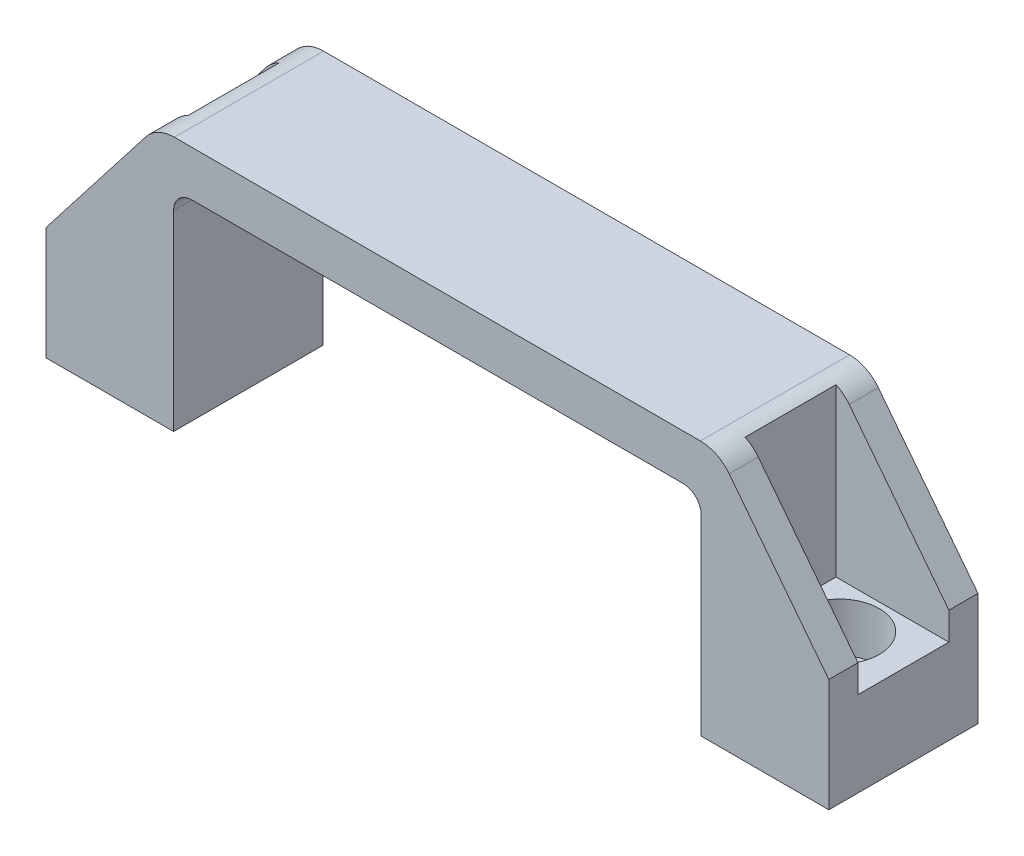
ISO-10303-21;
HEADER;
FILE_DESCRIPTION(('STEP AP214'),'2;1');
FILE_NAME('part.step','',(''),(''),'','','');
FILE_SCHEMA(('AUTOMOTIVE_DESIGN { 1 0 10303 214 1 1 1 1 }'));
ENDSEC;
DATA;
#1=APPLICATION_CONTEXT('core data for automotive mechanical design processes');
#2=APPLICATION_PROTOCOL_DEFINITION('international standard','automotive_design',2000,#1);
#3=PRODUCT_CONTEXT('',#1,'mechanical');
#4=PRODUCT('Part','Part','',(#3));
#5=PRODUCT_RELATED_PRODUCT_CATEGORY('part','',(#4));
#6=PRODUCT_DEFINITION_FORMATION('','',#4);
#7=PRODUCT_DEFINITION_CONTEXT('part definition',#1,'design');
#8=PRODUCT_DEFINITION('design','',#6,#7);
#9=PRODUCT_DEFINITION_SHAPE('','',#8);
#10=(LENGTH_UNIT() NAMED_UNIT(*) SI_UNIT(.MILLI.,.METRE.));
#11=(NAMED_UNIT(*) PLANE_ANGLE_UNIT() SI_UNIT($,.RADIAN.));
#12=(NAMED_UNIT(*) SI_UNIT($,.STERADIAN.) SOLID_ANGLE_UNIT());
#13=UNCERTAINTY_MEASURE_WITH_UNIT(LENGTH_MEASURE(1.E-05),#10,'distance_accuracy_value','');
#14=(GEOMETRIC_REPRESENTATION_CONTEXT(3) GLOBAL_UNCERTAINTY_ASSIGNED_CONTEXT((#13)) GLOBAL_UNIT_ASSIGNED_CONTEXT((#10,
#11,#12)) REPRESENTATION_CONTEXT('',''));
#15=CARTESIAN_POINT('',(0.,0.,0.));
#16=DIRECTION('',(0.,0.,1.));
#17=DIRECTION('',(1.,0.,0.));
#18=AXIS2_PLACEMENT_3D('',#15,#16,#17);
#19=CARTESIAN_POINT('',(0.,15.75435,10.414));
#20=DIRECTION('',(0.78974592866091,-0.613434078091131,0.));
#21=DIRECTION('',(0.613434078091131,0.78974592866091,0.));
#22=AXIS2_PLACEMENT_3D('',#19,#20,#21);
#23=PLANE('',#22);
#24=DIRECTION('',(0.,0.,-1.));
#25=VECTOR('',#24,1.);
#26=CARTESIAN_POINT('',(0.,15.75435,10.414));
#27=LINE('',#26,#25);
#28=CARTESIAN_POINT('',(0.,15.75435,-6.35));
#29=VERTEX_POINT('',#28);
#30=CARTESIAN_POINT('',(0.,15.75435,-10.414));
#31=VERTEX_POINT('',#30);
#32=EDGE_CURVE('E172',#29,#31,#27,.T.);
#33=ORIENTED_EDGE('',*,*,#32,.F.);
#34=DIRECTION('',(0.613434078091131,0.78974592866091,0.));
#35=VECTOR('',#34,1.);
#36=CARTESIAN_POINT('',(0.,15.75435,-6.35));
#37=LINE('',#36,#35);
#38=CARTESIAN_POINT('',(13.9178560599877,33.6724451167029,-6.35));
#39=VERTEX_POINT('',#38);
#40=EDGE_CURVE('E221',#29,#39,#37,.T.);
#41=ORIENTED_EDGE('',*,*,#40,.T.);
#42=DIRECTION('',(0.,0.,-1.));
#43=VECTOR('',#42,1.);
#44=CARTESIAN_POINT('',(13.9178560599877,33.6724451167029,10.414));
#45=LINE('',#44,#43);
#46=CARTESIAN_POINT('',(13.9178560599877,33.6724451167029,-10.414));
#47=VERTEX_POINT('',#46);
#48=EDGE_CURVE('E140',#39,#47,#45,.T.);
#49=ORIENTED_EDGE('',*,*,#48,.T.);
#50=DIRECTION('',(-0.613434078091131,-0.78974592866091,0.));
#51=VECTOR('',#50,1.);
#52=CARTESIAN_POINT('',(0.,15.75435,-10.414));
#53=LINE('',#52,#51);
#54=EDGE_CURVE('E166',#47,#31,#53,.T.);
#55=ORIENTED_EDGE('',*,*,#54,.T.);
#56=EDGE_LOOP('',(#33,#41,#49,#55));
#57=FACE_BOUND('',#56,.T.);
#58=ADVANCED_FACE('F39',(#57),#23,.F.);
#59=CARTESIAN_POINT('',(17.8181,0.,10.414));
#60=DIRECTION('',(0.,1.,0.));
#61=DIRECTION('',(-1.,0.,0.));
#62=AXIS2_PLACEMENT_3D('',#59,#60,#61);
#63=PLANE('',#62);
#64=CARTESIAN_POINT('',(8.9281,0.,0.));
#65=DIRECTION('',(0.,1.,0.));
#66=DIRECTION('',(0.,0.,1.));
#67=AXIS2_PLACEMENT_3D('',#64,#65,#66);
#68=CIRCLE('',#67,3.3782);
#69=CARTESIAN_POINT('',(8.9281,0.,3.3782));
#70=VERTEX_POINT('',#69);
#71=EDGE_CURVE('E256',#70,#70,#68,.T.);
#72=ORIENTED_EDGE('',*,*,#71,.T.);
#73=EDGE_LOOP('',(#72));
#74=FACE_BOUND('',#73,.T.);
#75=DIRECTION('',(1.,0.,0.));
#76=VECTOR('',#75,1.);
#77=CARTESIAN_POINT('',(17.8181,0.,-10.414));
#78=LINE('',#77,#76);
#79=CARTESIAN_POINT('',(0.,0.,-10.414));
#80=VERTEX_POINT('',#79);
#81=CARTESIAN_POINT('',(17.8181,0.,-10.414));
#82=VERTEX_POINT('',#81);
#83=EDGE_CURVE('E150',#80,#82,#78,.T.);
#84=ORIENTED_EDGE('',*,*,#83,.T.);
#85=DIRECTION('',(0.,0.,-1.));
#86=VECTOR('',#85,1.);
#87=CARTESIAN_POINT('',(17.8181,0.,10.414));
#88=LINE('',#87,#86);
#89=CARTESIAN_POINT('',(17.8181,0.,10.414));
#90=VERTEX_POINT('',#89);
#91=EDGE_CURVE('E47',#90,#82,#88,.T.);
#92=ORIENTED_EDGE('',*,*,#91,.F.);
#93=DIRECTION('',(1.,0.,0.));
#94=VECTOR('',#93,1.);
#95=CARTESIAN_POINT('',(17.8181,0.,10.414));
#96=LINE('',#95,#94);
#97=CARTESIAN_POINT('',(0.,0.,10.414));
#98=VERTEX_POINT('',#97);
#99=EDGE_CURVE('E170',#98,#90,#96,.T.);
#100=ORIENTED_EDGE('',*,*,#99,.F.);
#101=DIRECTION('',(0.,0.,-1.));
#102=VECTOR('',#101,1.);
#103=CARTESIAN_POINT('',(0.,0.,10.414));
#104=LINE('',#103,#102);
#105=EDGE_CURVE('E146',#98,#80,#104,.T.);
#106=ORIENTED_EDGE('',*,*,#105,.T.);
#107=EDGE_LOOP('',(#84,#92,#100,#106));
#108=FACE_BOUND('',#107,.T.);
#109=ADVANCED_FACE('F41',(#74,#108),#63,.F.);
#110=CARTESIAN_POINT('',(17.8181,26.7462,10.414));
#111=DIRECTION('',(-1.,0.,0.));
#112=DIRECTION('',(0.,-1.,0.));
#113=AXIS2_PLACEMENT_3D('',#110,#111,#112);
#114=PLANE('',#113);
#115=DIRECTION('',(0.,1.,0.));
#116=VECTOR('',#115,1.);
#117=CARTESIAN_POINT('',(17.8181,26.7462,-10.414));
#118=LINE('',#117,#116);
#119=CARTESIAN_POINT('',(17.8181,26.7462,-10.414));
#120=VERTEX_POINT('',#119);
#121=EDGE_CURVE('E153',#82,#120,#118,.T.);
#122=ORIENTED_EDGE('',*,*,#121,.T.);
#123=DIRECTION('',(0.,0.,-1.));
#124=VECTOR('',#123,1.);
#125=CARTESIAN_POINT('',(17.8181,26.7462,10.414));
#126=LINE('',#125,#124);
#127=CARTESIAN_POINT('',(17.8181,26.7462,10.414));
#128=VERTEX_POINT('',#127);
#129=EDGE_CURVE('E180',#128,#120,#126,.T.);
#130=ORIENTED_EDGE('',*,*,#129,.F.);
#131=DIRECTION('',(0.,1.,0.));
#132=VECTOR('',#131,1.);
#133=CARTESIAN_POINT('',(17.8181,26.7462,10.414));
#134=LINE('',#133,#132);
#135=EDGE_CURVE('E101',#90,#128,#134,.T.);
#136=ORIENTED_EDGE('',*,*,#135,.F.);
#137=ORIENTED_EDGE('',*,*,#91,.T.);
#138=EDGE_LOOP('',(#122,#130,#136,#137));
#139=FACE_BOUND('',#138,.T.);
#140=ADVANCED_FACE('F183',(#139),#114,.F.);
#141=CARTESIAN_POINT('',(20.3581,26.7462,10.414));
#142=DIRECTION('',(0.,0.,-1.));
#143=DIRECTION('',(-1.,0.,0.));
#144=AXIS2_PLACEMENT_3D('',#141,#142,#143);
#145=CYLINDRICAL_SURFACE('',#144,2.54);
#146=CARTESIAN_POINT('',(20.3581,26.7462,-10.414));
#147=DIRECTION('',(0.,0.,-1.));
#148=DIRECTION('',(1.,0.,0.));
#149=AXIS2_PLACEMENT_3D('',#146,#147,#148);
#150=CIRCLE('',#149,2.54);
#151=CARTESIAN_POINT('',(20.3581,29.2862,-10.414));
#152=VERTEX_POINT('',#151);
#153=EDGE_CURVE('E156',#120,#152,#150,.T.);
#154=ORIENTED_EDGE('',*,*,#153,.T.);
#155=DIRECTION('',(0.,0.,-1.));
#156=VECTOR('',#155,1.);
#157=CARTESIAN_POINT('',(20.3581,29.2862,10.414));
#158=LINE('',#157,#156);
#159=CARTESIAN_POINT('',(20.3581,29.2862,10.414));
#160=VERTEX_POINT('',#159);
#161=EDGE_CURVE('E176',#160,#152,#158,.T.);
#162=ORIENTED_EDGE('',*,*,#161,.F.);
#163=CARTESIAN_POINT('',(20.3581,26.7462,10.414));
#164=DIRECTION('',(0.,0.,-1.));
#165=DIRECTION('',(1.,0.,0.));
#166=AXIS2_PLACEMENT_3D('',#163,#164,#165);
#167=CIRCLE('',#166,2.54);
#168=EDGE_CURVE('E210',#128,#160,#167,.T.);
#169=ORIENTED_EDGE('',*,*,#168,.F.);
#170=ORIENTED_EDGE('',*,*,#129,.T.);
#171=EDGE_LOOP('',(#154,#162,#169,#170));
#172=FACE_BOUND('',#171,.T.);
#173=ADVANCED_FACE('F195',(#172),#145,.F.);
#174=CARTESIAN_POINT('',(54.6481,29.2862,10.414));
#175=DIRECTION('',(0.,1.,0.));
#176=DIRECTION('',(0.,0.,1.));
#177=AXIS2_PLACEMENT_3D('',#174,#175,#176);
#178=PLANE('',#177);
#179=DIRECTION('',(1.,0.,0.));
#180=VECTOR('',#179,1.);
#181=CARTESIAN_POINT('',(54.6481,29.2862,-10.414));
#182=LINE('',#181,#180);
#183=CARTESIAN_POINT('',(88.9381,29.2862,-10.414));
#184=VERTEX_POINT('',#183);
#185=EDGE_CURVE('E158',#152,#184,#182,.T.);
#186=ORIENTED_EDGE('',*,*,#185,.T.);
#187=DIRECTION('',(0.,0.,-1.));
#188=VECTOR('',#187,1.);
#189=CARTESIAN_POINT('',(88.9381,29.2862,10.414));
#190=LINE('',#189,#188);
#191=CARTESIAN_POINT('',(88.9381,29.2862,10.414));
#192=VERTEX_POINT('',#191);
#193=EDGE_CURVE('E206',#192,#184,#190,.T.);
#194=ORIENTED_EDGE('',*,*,#193,.F.);
#195=DIRECTION('',(1.,0.,0.));
#196=VECTOR('',#195,1.);
#197=CARTESIAN_POINT('',(54.6481,29.2862,10.414));
#198=LINE('',#197,#196);
#199=EDGE_CURVE('E204',#160,#192,#198,.T.);
#200=ORIENTED_EDGE('',*,*,#199,.F.);
#201=ORIENTED_EDGE('',*,*,#161,.T.);
#202=EDGE_LOOP('',(#186,#194,#200,#201));
#203=FACE_BOUND('',#202,.T.);
#204=ADVANCED_FACE('F199',(#203),#178,.F.);
#205=CARTESIAN_POINT('',(17.9297653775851,35.6362,10.414));
#206=DIRECTION('',(0.,-1.,0.));
#207=DIRECTION('',(0.,0.,-1.));
#208=AXIS2_PLACEMENT_3D('',#205,#206,#207);
#209=PLANE('',#208);
#210=DIRECTION('',(-1.,0.,0.));
#211=VECTOR('',#210,1.);
#212=CARTESIAN_POINT('',(17.9297653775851,35.6362,-10.414));
#213=LINE('',#212,#211);
#214=CARTESIAN_POINT('',(91.3664346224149,35.6362,-10.414));
#215=VERTEX_POINT('',#214);
#216=CARTESIAN_POINT('',(17.9297653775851,35.6362,-10.414));
#217=VERTEX_POINT('',#216);
#218=EDGE_CURVE('E161',#215,#217,#213,.T.);
#219=ORIENTED_EDGE('',*,*,#218,.T.);
#220=DIRECTION('',(0.,0.,-1.));
#221=VECTOR('',#220,1.);
#222=CARTESIAN_POINT('',(17.9297653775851,35.6362,10.414));
#223=LINE('',#222,#221);
#224=CARTESIAN_POINT('',(17.9297653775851,35.6362,10.414));
#225=VERTEX_POINT('',#224);
#226=EDGE_CURVE('E139',#225,#217,#223,.T.);
#227=ORIENTED_EDGE('',*,*,#226,.F.);
#228=DIRECTION('',(-1.,0.,0.));
#229=VECTOR('',#228,1.);
#230=CARTESIAN_POINT('',(17.9297653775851,35.6362,10.414));
#231=LINE('',#230,#229);
#232=CARTESIAN_POINT('',(91.3664346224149,35.6362,10.414));
#233=VERTEX_POINT('',#232);
#234=EDGE_CURVE('E123',#233,#225,#231,.T.);
#235=ORIENTED_EDGE('',*,*,#234,.F.);
#236=DIRECTION('',(0.,0.,-1.));
#237=VECTOR('',#236,1.);
#238=CARTESIAN_POINT('',(91.3664346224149,35.6362,10.414));
#239=LINE('',#238,#237);
#240=EDGE_CURVE('E269',#233,#215,#239,.T.);
#241=ORIENTED_EDGE('',*,*,#240,.T.);
#242=EDGE_LOOP('',(#219,#227,#235,#241));
#243=FACE_BOUND('',#242,.T.);
#244=ADVANCED_FACE('F441',(#243),#209,.F.);
#245=CARTESIAN_POINT('',(17.9297653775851,30.5562,10.414));
#246=DIRECTION('',(0.,0.,-1.));
#247=DIRECTION('',(-1.,0.,0.));
#248=AXIS2_PLACEMENT_3D('',#245,#246,#247);
#249=CYLINDRICAL_SURFACE('',#248,5.08);
#250=ORIENTED_EDGE('',*,*,#48,.F.);
#251=CARTESIAN_POINT('',(17.9297653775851,30.5562,-6.35));
#252=DIRECTION('',(0.,0.,-1.));
#253=DIRECTION('',(-1.,0.,0.));
#254=AXIS2_PLACEMENT_3D('',#251,#252,#253);
#255=CIRCLE('',#254,5.08);
#256=CARTESIAN_POINT('',(15.75435,35.1468391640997,-6.35));
#257=VERTEX_POINT('',#256);
#258=EDGE_CURVE('E154',#39,#257,#255,.T.);
#259=ORIENTED_EDGE('',*,*,#258,.T.);
#260=DIRECTION('',(0.,0.,-1.));
#261=VECTOR('',#260,1.);
#262=CARTESIAN_POINT('',(15.75435,35.1468391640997,10.414));
#263=LINE('',#262,#261);
#264=CARTESIAN_POINT('',(15.75435,35.1468391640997,6.34999999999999));
#265=VERTEX_POINT('',#264);
#266=EDGE_CURVE('E11',#257,#265,#263,.F.);
#267=ORIENTED_EDGE('',*,*,#266,.T.);
#268=CARTESIAN_POINT('',(17.9297653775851,30.5562,6.34999999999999));
#269=DIRECTION('',(0.,0.,1.));
#270=DIRECTION('',(1.,0.,0.));
#271=AXIS2_PLACEMENT_3D('',#268,#269,#270);
#272=CIRCLE('',#271,5.08);
#273=CARTESIAN_POINT('',(13.9178560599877,33.6724451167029,6.35));
#274=VERTEX_POINT('',#273);
#275=EDGE_CURVE('E136',#265,#274,#272,.T.);
#276=ORIENTED_EDGE('',*,*,#275,.T.);
#277=CARTESIAN_POINT('',(13.9178560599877,33.6724451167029,10.414));
#278=VERTEX_POINT('',#277);
#279=EDGE_CURVE('E131',#278,#274,#45,.T.);
#280=ORIENTED_EDGE('',*,*,#279,.F.);
#281=CARTESIAN_POINT('',(17.9297653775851,30.5562,10.414));
#282=DIRECTION('',(0.,0.,1.));
#283=DIRECTION('',(-1.,0.,0.));
#284=AXIS2_PLACEMENT_3D('',#281,#282,#283);
#285=CIRCLE('',#284,5.08);
#286=EDGE_CURVE('E115',#225,#278,#285,.T.);
#287=ORIENTED_EDGE('',*,*,#286,.F.);
#288=ORIENTED_EDGE('',*,*,#226,.T.);
#289=CARTESIAN_POINT('',(17.9297653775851,30.5562,-10.414));
#290=DIRECTION('',(0.,0.,1.));
#291=DIRECTION('',(-1.,0.,0.));
#292=AXIS2_PLACEMENT_3D('',#289,#290,#291);
#293=CIRCLE('',#292,5.08);
#294=EDGE_CURVE('E163',#217,#47,#293,.T.);
#295=ORIENTED_EDGE('',*,*,#294,.T.);
#296=EDGE_LOOP('',(#250,#259,#267,#276,#280,#287,#288,#295));
#297=FACE_BOUND('',#296,.T.);
#298=ADVANCED_FACE('F133',(#297),#249,.T.);
#299=ORIENTED_EDGE('',*,*,#279,.T.);
#300=DIRECTION('',(-0.613434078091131,-0.78974592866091,0.));
#301=VECTOR('',#300,1.);
#302=CARTESIAN_POINT('',(0.,15.75435,6.35));
#303=LINE('',#302,#301);
#304=CARTESIAN_POINT('',(0.,15.75435,6.35));
#305=VERTEX_POINT('',#304);
#306=EDGE_CURVE('E225',#274,#305,#303,.T.);
#307=ORIENTED_EDGE('',*,*,#306,.T.);
#308=CARTESIAN_POINT('',(0.,15.75435,10.414));
#309=VERTEX_POINT('',#308);
#310=EDGE_CURVE('E144',#309,#305,#27,.T.);
#311=ORIENTED_EDGE('',*,*,#310,.F.);
#312=DIRECTION('',(-0.613434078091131,-0.78974592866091,0.));
#313=VECTOR('',#312,1.);
#314=CARTESIAN_POINT('',(0.,15.75435,10.414));
#315=LINE('',#314,#313);
#316=EDGE_CURVE('E119',#278,#309,#315,.T.);
#317=ORIENTED_EDGE('',*,*,#316,.F.);
#318=EDGE_LOOP('',(#299,#307,#311,#317));
#319=FACE_BOUND('',#318,.T.);
#320=ADVANCED_FACE('F142',(#319),#23,.F.);
#321=CARTESIAN_POINT('',(0.,0.,10.414));
#322=DIRECTION('',(1.,0.,0.));
#323=DIRECTION('',(0.,0.,-1.));
#324=AXIS2_PLACEMENT_3D('',#321,#322,#323);
#325=PLANE('',#324);
#326=DIRECTION('',(0.,0.,1.));
#327=VECTOR('',#326,1.);
#328=CARTESIAN_POINT('',(0.,11.8872,6.35));
#329=LINE('',#328,#327);
#330=CARTESIAN_POINT('',(0.,11.8872,-6.35));
#331=VERTEX_POINT('',#330);
#332=CARTESIAN_POINT('',(0.,11.8872,6.35));
#333=VERTEX_POINT('',#332);
#334=EDGE_CURVE('E244',#331,#333,#329,.T.);
#335=ORIENTED_EDGE('',*,*,#334,.F.);
#336=DIRECTION('',(0.,1.,0.));
#337=VECTOR('',#336,1.);
#338=CARTESIAN_POINT('',(0.,11.8872,-6.35));
#339=LINE('',#338,#337);
#340=EDGE_CURVE('E228',#331,#29,#339,.T.);
#341=ORIENTED_EDGE('',*,*,#340,.T.);
#342=ORIENTED_EDGE('',*,*,#32,.T.);
#343=DIRECTION('',(0.,-1.,0.));
#344=VECTOR('',#343,1.);
#345=CARTESIAN_POINT('',(0.,0.,-10.414));
#346=LINE('',#345,#344);
#347=EDGE_CURVE('E92',#31,#80,#346,.T.);
#348=ORIENTED_EDGE('',*,*,#347,.T.);
#349=ORIENTED_EDGE('',*,*,#105,.F.);
#350=DIRECTION('',(0.,-1.,0.));
#351=VECTOR('',#350,1.);
#352=CARTESIAN_POINT('',(0.,0.,10.414));
#353=LINE('',#352,#351);
#354=EDGE_CURVE('E63',#309,#98,#353,.T.);
#355=ORIENTED_EDGE('',*,*,#354,.F.);
#356=ORIENTED_EDGE('',*,*,#310,.T.);
#357=DIRECTION('',(0.,1.,0.));
#358=VECTOR('',#357,1.);
#359=CARTESIAN_POINT('',(0.,11.8872,6.35));
#360=LINE('',#359,#358);
#361=EDGE_CURVE('E231',#333,#305,#360,.T.);
#362=ORIENTED_EDGE('',*,*,#361,.F.);
#363=EDGE_LOOP('',(#335,#341,#342,#348,#349,#355,#356,#362));
#364=FACE_BOUND('',#363,.T.);
#365=ADVANCED_FACE('F515',(#364),#325,.F.);
#366=CARTESIAN_POINT('',(17.9297653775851,30.5562,10.414));
#367=DIRECTION('',(0.,0.,-1.));
#368=DIRECTION('',(-1.,0.,0.));
#369=AXIS2_PLACEMENT_3D('',#366,#367,#368);
#370=PLANE('',#369);
#371=ORIENTED_EDGE('',*,*,#99,.T.);
#372=ORIENTED_EDGE('',*,*,#135,.T.);
#373=ORIENTED_EDGE('',*,*,#168,.T.);
#374=ORIENTED_EDGE('',*,*,#199,.T.);
#375=CARTESIAN_POINT('',(88.9381,26.7462,10.414));
#376=DIRECTION('',(0.,0.,1.));
#377=DIRECTION('',(-1.,0.,0.));
#378=AXIS2_PLACEMENT_3D('',#375,#376,#377);
#379=CIRCLE('',#378,2.54);
#380=CARTESIAN_POINT('',(91.4781,26.7462,10.414));
#381=VERTEX_POINT('',#380);
#382=EDGE_CURVE('E311',#381,#192,#379,.T.);
#383=ORIENTED_EDGE('',*,*,#382,.F.);
#384=DIRECTION('',(0.,1.,0.));
#385=VECTOR('',#384,1.);
#386=CARTESIAN_POINT('',(91.4781,26.7462,10.414));
#387=LINE('',#386,#385);
#388=CARTESIAN_POINT('',(91.4781,0.,10.414));
#389=VERTEX_POINT('',#388);
#390=EDGE_CURVE('E313',#389,#381,#387,.T.);
#391=ORIENTED_EDGE('',*,*,#390,.F.);
#392=DIRECTION('',(-1.,0.,0.));
#393=VECTOR('',#392,1.);
#394=CARTESIAN_POINT('',(91.4781,0.,10.414));
#395=LINE('',#394,#393);
#396=CARTESIAN_POINT('',(109.2962,0.,10.414));
#397=VERTEX_POINT('',#396);
#398=EDGE_CURVE('E287',#397,#389,#395,.T.);
#399=ORIENTED_EDGE('',*,*,#398,.F.);
#400=DIRECTION('',(0.,-1.,0.));
#401=VECTOR('',#400,1.);
#402=CARTESIAN_POINT('',(109.2962,0.,10.414));
#403=LINE('',#402,#401);
#404=CARTESIAN_POINT('',(109.2962,15.75435,10.414));
#405=VERTEX_POINT('',#404);
#406=EDGE_CURVE('E283',#405,#397,#403,.T.);
#407=ORIENTED_EDGE('',*,*,#406,.F.);
#408=DIRECTION('',(0.613434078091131,-0.78974592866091,0.));
#409=VECTOR('',#408,1.);
#410=CARTESIAN_POINT('',(109.2962,15.75435,10.414));
#411=LINE('',#410,#409);
#412=CARTESIAN_POINT('',(95.3783439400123,33.6724451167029,10.414));
#413=VERTEX_POINT('',#412);
#414=EDGE_CURVE('E305',#413,#405,#411,.T.);
#415=ORIENTED_EDGE('',*,*,#414,.F.);
#416=CARTESIAN_POINT('',(91.3664346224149,30.5562,10.414));
#417=DIRECTION('',(0.,0.,-1.));
#418=DIRECTION('',(1.,0.,0.));
#419=AXIS2_PLACEMENT_3D('',#416,#417,#418);
#420=CIRCLE('',#419,5.08);
#421=EDGE_CURVE('E308',#233,#413,#420,.T.);
#422=ORIENTED_EDGE('',*,*,#421,.F.);
#423=ORIENTED_EDGE('',*,*,#234,.T.);
#424=ORIENTED_EDGE('',*,*,#286,.T.);
#425=ORIENTED_EDGE('',*,*,#316,.T.);
#426=ORIENTED_EDGE('',*,*,#354,.T.);
#427=EDGE_LOOP('',(#371,#372,#373,#374,#383,#391,#399,#407,#415,#422,#423,#424,#425,#426));
#428=FACE_BOUND('',#427,.T.);
#429=ADVANCED_FACE('F117',(#428),#370,.F.);
#430=CARTESIAN_POINT('',(17.9297653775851,30.5562,-10.414));
#431=DIRECTION('',(0.,0.,-1.));
#432=DIRECTION('',(-1.,0.,0.));
#433=AXIS2_PLACEMENT_3D('',#430,#431,#432);
#434=PLANE('',#433);
#435=ORIENTED_EDGE('',*,*,#83,.F.);
#436=ORIENTED_EDGE('',*,*,#347,.F.);
#437=ORIENTED_EDGE('',*,*,#54,.F.);
#438=ORIENTED_EDGE('',*,*,#294,.F.);
#439=ORIENTED_EDGE('',*,*,#218,.F.);
#440=CARTESIAN_POINT('',(91.3664346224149,30.5562,-10.414));
#441=DIRECTION('',(0.,0.,-1.));
#442=DIRECTION('',(1.,0.,0.));
#443=AXIS2_PLACEMENT_3D('',#440,#441,#442);
#444=CIRCLE('',#443,5.08);
#445=CARTESIAN_POINT('',(95.3783439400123,33.6724451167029,-10.414));
#446=VERTEX_POINT('',#445);
#447=EDGE_CURVE('E291',#215,#446,#444,.T.);
#448=ORIENTED_EDGE('',*,*,#447,.T.);
#449=DIRECTION('',(0.613434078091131,-0.78974592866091,0.));
#450=VECTOR('',#449,1.);
#451=CARTESIAN_POINT('',(109.2962,15.75435,-10.414));
#452=LINE('',#451,#450);
#453=CARTESIAN_POINT('',(109.2962,15.75435,-10.414));
#454=VERTEX_POINT('',#453);
#455=EDGE_CURVE('E288',#446,#454,#452,.T.);
#456=ORIENTED_EDGE('',*,*,#455,.T.);
#457=DIRECTION('',(0.,-1.,0.));
#458=VECTOR('',#457,1.);
#459=CARTESIAN_POINT('',(109.2962,0.,-10.414));
#460=LINE('',#459,#458);
#461=CARTESIAN_POINT('',(109.2962,0.,-10.414));
#462=VERTEX_POINT('',#461);
#463=EDGE_CURVE('E284',#454,#462,#460,.T.);
#464=ORIENTED_EDGE('',*,*,#463,.T.);
#465=DIRECTION('',(-1.,0.,0.));
#466=VECTOR('',#465,1.);
#467=CARTESIAN_POINT('',(91.4781,0.,-10.414));
#468=LINE('',#467,#466);
#469=CARTESIAN_POINT('',(91.4781,0.,-10.414));
#470=VERTEX_POINT('',#469);
#471=EDGE_CURVE('E299',#462,#470,#468,.T.);
#472=ORIENTED_EDGE('',*,*,#471,.T.);
#473=DIRECTION('',(0.,1.,0.));
#474=VECTOR('',#473,1.);
#475=CARTESIAN_POINT('',(91.4781,26.7462,-10.414));
#476=LINE('',#475,#474);
#477=CARTESIAN_POINT('',(91.4781,26.7462,-10.414));
#478=VERTEX_POINT('',#477);
#479=EDGE_CURVE('E296',#470,#478,#476,.T.);
#480=ORIENTED_EDGE('',*,*,#479,.T.);
#481=CARTESIAN_POINT('',(88.9381,26.7462,-10.414));
#482=DIRECTION('',(0.,0.,1.));
#483=DIRECTION('',(-1.,0.,0.));
#484=AXIS2_PLACEMENT_3D('',#481,#482,#483);
#485=CIRCLE('',#484,2.54);
#486=EDGE_CURVE('E294',#478,#184,#485,.T.);
#487=ORIENTED_EDGE('',*,*,#486,.T.);
#488=ORIENTED_EDGE('',*,*,#185,.F.);
#489=ORIENTED_EDGE('',*,*,#153,.F.);
#490=ORIENTED_EDGE('',*,*,#121,.F.);
#491=EDGE_LOOP('',(#435,#436,#437,#438,#439,#448,#456,#464,#472,#480,#487,#488,#489,#490));
#492=FACE_BOUND('',#491,.T.);
#493=ADVANCED_FACE('F188',(#492),#434,.T.);
#494=CARTESIAN_POINT('',(15.75435,11.8872,-6.35));
#495=DIRECTION('',(1.,0.,0.));
#496=DIRECTION('',(0.,0.,-1.));
#497=AXIS2_PLACEMENT_3D('',#494,#495,#496);
#498=PLANE('',#497);
#499=DIRECTION('',(0.,1.,0.));
#500=VECTOR('',#499,1.);
#501=CARTESIAN_POINT('',(15.75435,11.8872,-6.35));
#502=LINE('',#501,#500);
#503=CARTESIAN_POINT('',(15.75435,11.8872,-6.35));
#504=VERTEX_POINT('',#503);
#505=EDGE_CURVE('E227',#504,#257,#502,.T.);
#506=ORIENTED_EDGE('',*,*,#505,.F.);
#507=DIRECTION('',(0.,0.,-1.));
#508=VECTOR('',#507,1.);
#509=CARTESIAN_POINT('',(15.75435,11.8872,-6.35));
#510=LINE('',#509,#508);
#511=CARTESIAN_POINT('',(15.75435,11.8872,6.34999999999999));
#512=VERTEX_POINT('',#511);
#513=EDGE_CURVE('E232',#512,#504,#510,.T.);
#514=ORIENTED_EDGE('',*,*,#513,.F.);
#515=DIRECTION('',(0.,1.,0.));
#516=VECTOR('',#515,1.);
#517=CARTESIAN_POINT('',(15.75435,11.8872,6.34999999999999));
#518=LINE('',#517,#516);
#519=EDGE_CURVE('E235',#512,#265,#518,.T.);
#520=ORIENTED_EDGE('',*,*,#519,.T.);
#521=ORIENTED_EDGE('',*,*,#266,.F.);
#522=EDGE_LOOP('',(#506,#514,#520,#521));
#523=FACE_BOUND('',#522,.T.);
#524=ADVANCED_FACE('F569',(#523),#498,.F.);
#525=CARTESIAN_POINT('',(0.,11.8872,-6.35));
#526=DIRECTION('',(0.,0.,-1.));
#527=DIRECTION('',(-1.,0.,0.));
#528=AXIS2_PLACEMENT_3D('',#525,#526,#527);
#529=PLANE('',#528);
#530=ORIENTED_EDGE('',*,*,#40,.F.);
#531=ORIENTED_EDGE('',*,*,#340,.F.);
#532=DIRECTION('',(-1.,0.,0.));
#533=VECTOR('',#532,1.);
#534=CARTESIAN_POINT('',(0.,11.8872,-6.35));
#535=LINE('',#534,#533);
#536=EDGE_CURVE('E54',#504,#331,#535,.T.);
#537=ORIENTED_EDGE('',*,*,#536,.F.);
#538=ORIENTED_EDGE('',*,*,#505,.T.);
#539=ORIENTED_EDGE('',*,*,#258,.F.);
#540=EDGE_LOOP('',(#530,#531,#537,#538,#539));
#541=FACE_BOUND('',#540,.T.);
#542=ADVANCED_FACE('F428',(#541),#529,.F.);
#543=CARTESIAN_POINT('',(0.,11.8872,6.35));
#544=DIRECTION('',(0.,0.,1.));
#545=DIRECTION('',(1.,0.,0.));
#546=AXIS2_PLACEMENT_3D('',#543,#544,#545);
#547=PLANE('',#546);
#548=ORIENTED_EDGE('',*,*,#519,.F.);
#549=DIRECTION('',(1.,0.,0.));
#550=VECTOR('',#549,1.);
#551=CARTESIAN_POINT('',(0.,11.8872,6.35));
#552=LINE('',#551,#550);
#553=EDGE_CURVE('E241',#333,#512,#552,.T.);
#554=ORIENTED_EDGE('',*,*,#553,.F.);
#555=ORIENTED_EDGE('',*,*,#361,.T.);
#556=ORIENTED_EDGE('',*,*,#306,.F.);
#557=ORIENTED_EDGE('',*,*,#275,.F.);
#558=EDGE_LOOP('',(#548,#554,#555,#556,#557));
#559=FACE_BOUND('',#558,.T.);
#560=ADVANCED_FACE('F704',(#559),#547,.F.);
#561=CARTESIAN_POINT('',(0.,11.8872,-6.35));
#562=DIRECTION('',(0.,1.,0.));
#563=DIRECTION('',(0.,0.,1.));
#564=AXIS2_PLACEMENT_3D('',#561,#562,#563);
#565=PLANE('',#564);
#566=CARTESIAN_POINT('',(8.9281,11.8872,0.));
#567=DIRECTION('',(0.,1.,0.));
#568=DIRECTION('',(0.,0.,1.));
#569=AXIS2_PLACEMENT_3D('',#566,#567,#568);
#570=CIRCLE('',#569,5.55625);
#571=CARTESIAN_POINT('',(8.9281,11.8872,5.55624999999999));
#572=VERTEX_POINT('',#571);
#573=EDGE_CURVE('E247',#572,#572,#570,.T.);
#574=ORIENTED_EDGE('',*,*,#573,.F.);
#575=EDGE_LOOP('',(#574));
#576=FACE_BOUND('',#575,.T.);
#577=ORIENTED_EDGE('',*,*,#536,.T.);
#578=ORIENTED_EDGE('',*,*,#334,.T.);
#579=ORIENTED_EDGE('',*,*,#553,.T.);
#580=ORIENTED_EDGE('',*,*,#513,.T.);
#581=EDGE_LOOP('',(#577,#578,#579,#580));
#582=FACE_BOUND('',#581,.T.);
#583=ADVANCED_FACE('F700',(#576,#582),#565,.T.);
#584=CARTESIAN_POINT('',(8.9281,11.8872,0.));
#585=DIRECTION('',(0.,1.,0.));
#586=DIRECTION('',(0.,0.,1.));
#587=AXIS2_PLACEMENT_3D('',#584,#585,#586);
#588=CYLINDRICAL_SURFACE('',#587,5.55625);
#589=CARTESIAN_POINT('',(8.9281,5.0292,0.));
#590=DIRECTION('',(0.,1.,0.));
#591=DIRECTION('',(0.,0.,1.));
#592=AXIS2_PLACEMENT_3D('',#589,#590,#591);
#593=CIRCLE('',#592,5.55625);
#594=CARTESIAN_POINT('',(8.9281,5.0292,5.55624999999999));
#595=VERTEX_POINT('',#594);
#596=EDGE_CURVE('E250',#595,#595,#593,.T.);
#597=ORIENTED_EDGE('',*,*,#596,.F.);
#598=EDGE_LOOP('',(#597));
#599=FACE_BOUND('',#598,.T.);
#600=ORIENTED_EDGE('',*,*,#573,.T.);
#601=EDGE_LOOP('',(#600));
#602=FACE_BOUND('',#601,.T.);
#603=ADVANCED_FACE('F696',(#599,#602),#588,.F.);
#604=CARTESIAN_POINT('',(12.3063,5.0292,0.));
#605=DIRECTION('',(0.,-1.,0.));
#606=DIRECTION('',(0.,0.,-1.));
#607=AXIS2_PLACEMENT_3D('',#604,#605,#606);
#608=PLANE('',#607);
#609=CARTESIAN_POINT('',(8.9281,5.0292,0.));
#610=DIRECTION('',(0.,1.,0.));
#611=DIRECTION('',(0.,0.,1.));
#612=AXIS2_PLACEMENT_3D('',#609,#610,#611);
#613=CIRCLE('',#612,3.37820000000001);
#614=CARTESIAN_POINT('',(8.9281,5.0292,3.37820000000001));
#615=VERTEX_POINT('',#614);
#616=EDGE_CURVE('E253',#615,#615,#613,.T.);
#617=ORIENTED_EDGE('',*,*,#616,.F.);
#618=EDGE_LOOP('',(#617));
#619=FACE_BOUND('',#618,.T.);
#620=ORIENTED_EDGE('',*,*,#596,.T.);
#621=EDGE_LOOP('',(#620));
#622=FACE_BOUND('',#621,.T.);
#623=ADVANCED_FACE('F499',(#619,#622),#608,.F.);
#624=CARTESIAN_POINT('',(8.9281,11.8872,0.));
#625=DIRECTION('',(0.,1.,0.));
#626=DIRECTION('',(0.,0.,1.));
#627=AXIS2_PLACEMENT_3D('',#624,#625,#626);
#628=CYLINDRICAL_SURFACE('',#627,3.3782);
#629=ORIENTED_EDGE('',*,*,#71,.F.);
#630=EDGE_LOOP('',(#629));
#631=FACE_BOUND('',#630,.T.);
#632=ORIENTED_EDGE('',*,*,#616,.T.);
#633=EDGE_LOOP('',(#632));
#634=FACE_BOUND('',#633,.T.);
#635=ADVANCED_FACE('F493',(#631,#634),#628,.F.);
#636=CARTESIAN_POINT('',(109.2962,15.75435,10.414));
#637=DIRECTION('',(-0.78974592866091,-0.613434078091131,0.));
#638=DIRECTION('',(-0.613434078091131,0.78974592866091,0.));
#639=AXIS2_PLACEMENT_3D('',#636,#637,#638);
#640=PLANE('',#639);
#641=DIRECTION('',(0.,0.,-1.));
#642=VECTOR('',#641,1.);
#643=CARTESIAN_POINT('',(109.2962,15.75435,10.414));
#644=LINE('',#643,#642);
#645=CARTESIAN_POINT('',(109.2962,15.75435,-6.35));
#646=VERTEX_POINT('',#645);
#647=EDGE_CURVE('E279',#646,#454,#644,.T.);
#648=ORIENTED_EDGE('',*,*,#647,.T.);
#649=ORIENTED_EDGE('',*,*,#455,.F.);
#650=DIRECTION('',(0.,0.,-1.));
#651=VECTOR('',#650,1.);
#652=CARTESIAN_POINT('',(95.3783439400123,33.6724451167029,10.414));
#653=LINE('',#652,#651);
#654=CARTESIAN_POINT('',(95.3783439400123,33.6724451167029,-6.35));
#655=VERTEX_POINT('',#654);
#656=EDGE_CURVE('E275',#655,#446,#653,.T.);
#657=ORIENTED_EDGE('',*,*,#656,.F.);
#658=DIRECTION('',(-0.613434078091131,0.78974592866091,0.));
#659=VECTOR('',#658,1.);
#660=CARTESIAN_POINT('',(109.2962,15.75435,-6.35));
#661=LINE('',#660,#659);
#662=EDGE_CURVE('E320',#646,#655,#661,.T.);
#663=ORIENTED_EDGE('',*,*,#662,.F.);
#664=EDGE_LOOP('',(#648,#649,#657,#663));
#665=FACE_BOUND('',#664,.T.);
#666=ADVANCED_FACE('F373',(#665),#640,.F.);
#667=CARTESIAN_POINT('',(91.4781,0.,10.414));
#668=DIRECTION('',(0.,1.,0.));
#669=DIRECTION('',(1.,0.,0.));
#670=AXIS2_PLACEMENT_3D('',#667,#668,#669);
#671=PLANE('',#670);
#672=CARTESIAN_POINT('',(100.3681,0.,0.));
#673=DIRECTION('',(0.,-1.,0.));
#674=DIRECTION('',(0.,0.,1.));
#675=AXIS2_PLACEMENT_3D('',#672,#673,#674);
#676=CIRCLE('',#675,3.3782);
#677=CARTESIAN_POINT('',(100.3681,0.,3.3782));
#678=VERTEX_POINT('',#677);
#679=EDGE_CURVE('E362',#678,#678,#676,.T.);
#680=ORIENTED_EDGE('',*,*,#679,.F.);
#681=EDGE_LOOP('',(#680));
#682=FACE_BOUND('',#681,.T.);
#683=ORIENTED_EDGE('',*,*,#471,.F.);
#684=DIRECTION('',(0.,0.,-1.));
#685=VECTOR('',#684,1.);
#686=CARTESIAN_POINT('',(109.2962,0.,10.414));
#687=LINE('',#686,#685);
#688=EDGE_CURVE('E280',#397,#462,#687,.T.);
#689=ORIENTED_EDGE('',*,*,#688,.F.);
#690=ORIENTED_EDGE('',*,*,#398,.T.);
#691=DIRECTION('',(0.,0.,-1.));
#692=VECTOR('',#691,1.);
#693=CARTESIAN_POINT('',(91.4781,0.,10.414));
#694=LINE('',#693,#692);
#695=EDGE_CURVE('E262',#389,#470,#694,.T.);
#696=ORIENTED_EDGE('',*,*,#695,.T.);
#697=EDGE_LOOP('',(#683,#689,#690,#696));
#698=FACE_BOUND('',#697,.T.);
#699=ADVANCED_FACE('F369',(#682,#698),#671,.F.);
#700=CARTESIAN_POINT('',(91.4781,26.7462,10.414));
#701=DIRECTION('',(1.,0.,0.));
#702=DIRECTION('',(0.,-1.,0.));
#703=AXIS2_PLACEMENT_3D('',#700,#701,#702);
#704=PLANE('',#703);
#705=ORIENTED_EDGE('',*,*,#479,.F.);
#706=ORIENTED_EDGE('',*,*,#695,.F.);
#707=ORIENTED_EDGE('',*,*,#390,.T.);
#708=DIRECTION('',(0.,0.,-1.));
#709=VECTOR('',#708,1.);
#710=CARTESIAN_POINT('',(91.4781,26.7462,10.414));
#711=LINE('',#710,#709);
#712=EDGE_CURVE('E265',#381,#478,#711,.T.);
#713=ORIENTED_EDGE('',*,*,#712,.T.);
#714=EDGE_LOOP('',(#705,#706,#707,#713));
#715=FACE_BOUND('',#714,.T.);
#716=ADVANCED_FACE('F372',(#715),#704,.F.);
#717=CARTESIAN_POINT('',(88.9381,26.7462,10.414));
#718=DIRECTION('',(0.,0.,-1.));
#719=DIRECTION('',(1.,0.,0.));
#720=AXIS2_PLACEMENT_3D('',#717,#718,#719);
#721=CYLINDRICAL_SURFACE('',#720,2.54);
#722=ORIENTED_EDGE('',*,*,#486,.F.);
#723=ORIENTED_EDGE('',*,*,#712,.F.);
#724=ORIENTED_EDGE('',*,*,#382,.T.);
#725=ORIENTED_EDGE('',*,*,#193,.T.);
#726=EDGE_LOOP('',(#722,#723,#724,#725));
#727=FACE_BOUND('',#726,.T.);
#728=ADVANCED_FACE('F591',(#727),#721,.F.);
#729=CARTESIAN_POINT('',(91.3664346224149,30.5562,10.414));
#730=DIRECTION('',(0.,0.,-1.));
#731=DIRECTION('',(1.,0.,0.));
#732=AXIS2_PLACEMENT_3D('',#729,#730,#731);
#733=CYLINDRICAL_SURFACE('',#732,5.08);
#734=ORIENTED_EDGE('',*,*,#656,.T.);
#735=ORIENTED_EDGE('',*,*,#447,.F.);
#736=ORIENTED_EDGE('',*,*,#240,.F.);
#737=ORIENTED_EDGE('',*,*,#421,.T.);
#738=CARTESIAN_POINT('',(95.3783439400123,33.6724451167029,6.35));
#739=VERTEX_POINT('',#738);
#740=EDGE_CURVE('E272',#413,#739,#653,.T.);
#741=ORIENTED_EDGE('',*,*,#740,.T.);
#742=CARTESIAN_POINT('',(91.3664346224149,30.5562,6.34999999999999));
#743=DIRECTION('',(0.,0.,-1.));
#744=DIRECTION('',(-1.,0.,0.));
#745=AXIS2_PLACEMENT_3D('',#742,#743,#744);
#746=CIRCLE('',#745,5.08);
#747=CARTESIAN_POINT('',(93.54185,35.1468391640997,6.34999999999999));
#748=VERTEX_POINT('',#747);
#749=EDGE_CURVE('E323',#748,#739,#746,.T.);
#750=ORIENTED_EDGE('',*,*,#749,.F.);
#751=DIRECTION('',(0.,0.,-1.));
#752=VECTOR('',#751,1.);
#753=CARTESIAN_POINT('',(93.54185,35.1468391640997,10.414));
#754=LINE('',#753,#752);
#755=CARTESIAN_POINT('',(93.54185,35.1468391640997,-6.35));
#756=VERTEX_POINT('',#755);
#757=EDGE_CURVE('E259',#756,#748,#754,.F.);
#758=ORIENTED_EDGE('',*,*,#757,.F.);
#759=CARTESIAN_POINT('',(91.3664346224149,30.5562,-6.35));
#760=DIRECTION('',(0.,0.,1.));
#761=DIRECTION('',(1.,0.,0.));
#762=AXIS2_PLACEMENT_3D('',#759,#760,#761);
#763=CIRCLE('',#762,5.08);
#764=EDGE_CURVE('E302',#655,#756,#763,.T.);
#765=ORIENTED_EDGE('',*,*,#764,.F.);
#766=EDGE_LOOP('',(#734,#735,#736,#737,#741,#750,#758,#765));
#767=FACE_BOUND('',#766,.T.);
#768=ADVANCED_FACE('F437',(#767),#733,.T.);
#769=ORIENTED_EDGE('',*,*,#740,.F.);
#770=ORIENTED_EDGE('',*,*,#414,.T.);
#771=CARTESIAN_POINT('',(109.2962,15.75435,6.35));
#772=VERTEX_POINT('',#771);
#773=EDGE_CURVE('E276',#405,#772,#644,.T.);
#774=ORIENTED_EDGE('',*,*,#773,.T.);
#775=DIRECTION('',(0.613434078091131,-0.78974592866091,0.));
#776=VECTOR('',#775,1.);
#777=CARTESIAN_POINT('',(109.2962,15.75435,6.35));
#778=LINE('',#777,#776);
#779=EDGE_CURVE('E326',#739,#772,#778,.T.);
#780=ORIENTED_EDGE('',*,*,#779,.F.);
#781=EDGE_LOOP('',(#769,#770,#774,#780));
#782=FACE_BOUND('',#781,.T.);
#783=ADVANCED_FACE('F495',(#782),#640,.F.);
#784=CARTESIAN_POINT('',(109.2962,0.,10.414));
#785=DIRECTION('',(-1.,0.,0.));
#786=DIRECTION('',(0.,0.,-1.));
#787=AXIS2_PLACEMENT_3D('',#784,#785,#786);
#788=PLANE('',#787);
#789=DIRECTION('',(0.,0.,1.));
#790=VECTOR('',#789,1.);
#791=CARTESIAN_POINT('',(109.2962,11.8872,6.35));
#792=LINE('',#791,#790);
#793=CARTESIAN_POINT('',(109.2962,11.8872,-6.35));
#794=VERTEX_POINT('',#793);
#795=CARTESIAN_POINT('',(109.2962,11.8872,6.35));
#796=VERTEX_POINT('',#795);
#797=EDGE_CURVE('E347',#794,#796,#792,.T.);
#798=ORIENTED_EDGE('',*,*,#797,.T.);
#799=DIRECTION('',(0.,1.,0.));
#800=VECTOR('',#799,1.);
#801=CARTESIAN_POINT('',(109.2962,11.8872,6.35));
#802=LINE('',#801,#800);
#803=EDGE_CURVE('E333',#796,#772,#802,.T.);
#804=ORIENTED_EDGE('',*,*,#803,.T.);
#805=ORIENTED_EDGE('',*,*,#773,.F.);
#806=ORIENTED_EDGE('',*,*,#406,.T.);
#807=ORIENTED_EDGE('',*,*,#688,.T.);
#808=ORIENTED_EDGE('',*,*,#463,.F.);
#809=ORIENTED_EDGE('',*,*,#647,.F.);
#810=DIRECTION('',(0.,1.,0.));
#811=VECTOR('',#810,1.);
#812=CARTESIAN_POINT('',(109.2962,11.8872,-6.35));
#813=LINE('',#812,#811);
#814=EDGE_CURVE('E330',#794,#646,#813,.T.);
#815=ORIENTED_EDGE('',*,*,#814,.F.);
#816=EDGE_LOOP('',(#798,#804,#805,#806,#807,#808,#809,#815));
#817=FACE_BOUND('',#816,.T.);
#818=ADVANCED_FACE('F484',(#817),#788,.F.);
#819=CARTESIAN_POINT('',(93.54185,11.8872,-6.35));
#820=DIRECTION('',(-1.,0.,0.));
#821=DIRECTION('',(0.,0.,-1.));
#822=AXIS2_PLACEMENT_3D('',#819,#820,#821);
#823=PLANE('',#822);
#824=DIRECTION('',(0.,1.,0.));
#825=VECTOR('',#824,1.);
#826=CARTESIAN_POINT('',(93.54185,11.8872,-6.35));
#827=LINE('',#826,#825);
#828=CARTESIAN_POINT('',(93.54185,11.8872,-6.35));
#829=VERTEX_POINT('',#828);
#830=EDGE_CURVE('E329',#829,#756,#827,.T.);
#831=ORIENTED_EDGE('',*,*,#830,.T.);
#832=ORIENTED_EDGE('',*,*,#757,.T.);
#833=DIRECTION('',(0.,1.,0.));
#834=VECTOR('',#833,1.);
#835=CARTESIAN_POINT('',(93.54185,11.8872,6.34999999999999));
#836=LINE('',#835,#834);
#837=CARTESIAN_POINT('',(93.54185,11.8872,6.34999999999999));
#838=VERTEX_POINT('',#837);
#839=EDGE_CURVE('E337',#838,#748,#836,.T.);
#840=ORIENTED_EDGE('',*,*,#839,.F.);
#841=DIRECTION('',(0.,0.,-1.));
#842=VECTOR('',#841,1.);
#843=CARTESIAN_POINT('',(93.54185,11.8872,-6.35));
#844=LINE('',#843,#842);
#845=EDGE_CURVE('E334',#838,#829,#844,.T.);
#846=ORIENTED_EDGE('',*,*,#845,.T.);
#847=EDGE_LOOP('',(#831,#832,#840,#846));
#848=FACE_BOUND('',#847,.T.);
#849=ADVANCED_FACE('F622',(#848),#823,.F.);
#850=CARTESIAN_POINT('',(109.2962,11.8872,-6.35));
#851=DIRECTION('',(0.,0.,-1.));
#852=DIRECTION('',(1.,0.,0.));
#853=AXIS2_PLACEMENT_3D('',#850,#851,#852);
#854=PLANE('',#853);
#855=ORIENTED_EDGE('',*,*,#662,.T.);
#856=ORIENTED_EDGE('',*,*,#764,.T.);
#857=ORIENTED_EDGE('',*,*,#830,.F.);
#858=DIRECTION('',(1.,0.,0.));
#859=VECTOR('',#858,1.);
#860=CARTESIAN_POINT('',(109.2962,11.8872,-6.35));
#861=LINE('',#860,#859);
#862=EDGE_CURVE('E350',#829,#794,#861,.T.);
#863=ORIENTED_EDGE('',*,*,#862,.T.);
#864=ORIENTED_EDGE('',*,*,#814,.T.);
#865=EDGE_LOOP('',(#855,#856,#857,#863,#864));
#866=FACE_BOUND('',#865,.T.);
#867=ADVANCED_FACE('F489',(#866),#854,.F.);
#868=CARTESIAN_POINT('',(109.2962,11.8872,6.35));
#869=DIRECTION('',(0.,0.,1.));
#870=DIRECTION('',(-1.,0.,0.));
#871=AXIS2_PLACEMENT_3D('',#868,#869,#870);
#872=PLANE('',#871);
#873=ORIENTED_EDGE('',*,*,#839,.T.);
#874=ORIENTED_EDGE('',*,*,#749,.T.);
#875=ORIENTED_EDGE('',*,*,#779,.T.);
#876=ORIENTED_EDGE('',*,*,#803,.F.);
#877=DIRECTION('',(-1.,0.,0.));
#878=VECTOR('',#877,1.);
#879=CARTESIAN_POINT('',(109.2962,11.8872,6.35));
#880=LINE('',#879,#878);
#881=EDGE_CURVE('E344',#796,#838,#880,.T.);
#882=ORIENTED_EDGE('',*,*,#881,.T.);
#883=EDGE_LOOP('',(#873,#874,#875,#876,#882));
#884=FACE_BOUND('',#883,.T.);
#885=ADVANCED_FACE('F480',(#884),#872,.F.);
#886=CARTESIAN_POINT('',(109.2962,11.8872,-6.35));
#887=DIRECTION('',(0.,1.,0.));
#888=DIRECTION('',(0.,0.,1.));
#889=AXIS2_PLACEMENT_3D('',#886,#887,#888);
#890=PLANE('',#889);
#891=CARTESIAN_POINT('',(100.3681,11.8872,0.));
#892=DIRECTION('',(0.,-1.,0.));
#893=DIRECTION('',(0.,0.,1.));
#894=AXIS2_PLACEMENT_3D('',#891,#892,#893);
#895=CIRCLE('',#894,5.55625);
#896=CARTESIAN_POINT('',(100.3681,11.8872,5.55624999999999));
#897=VERTEX_POINT('',#896);
#898=EDGE_CURVE('E353',#897,#897,#895,.T.);
#899=ORIENTED_EDGE('',*,*,#898,.T.);
#900=EDGE_LOOP('',(#899));
#901=FACE_BOUND('',#900,.T.);
#902=ORIENTED_EDGE('',*,*,#862,.F.);
#903=ORIENTED_EDGE('',*,*,#845,.F.);
#904=ORIENTED_EDGE('',*,*,#881,.F.);
#905=ORIENTED_EDGE('',*,*,#797,.F.);
#906=EDGE_LOOP('',(#902,#903,#904,#905));
#907=FACE_BOUND('',#906,.T.);
#908=ADVANCED_FACE('F477',(#901,#907),#890,.T.);
#909=CARTESIAN_POINT('',(100.3681,11.8872,0.));
#910=DIRECTION('',(0.,1.,0.));
#911=DIRECTION('',(0.,0.,1.));
#912=AXIS2_PLACEMENT_3D('',#909,#910,#911);
#913=CYLINDRICAL_SURFACE('',#912,5.55625);
#914=CARTESIAN_POINT('',(100.3681,5.0292,0.));
#915=DIRECTION('',(0.,-1.,0.));
#916=DIRECTION('',(0.,0.,1.));
#917=AXIS2_PLACEMENT_3D('',#914,#915,#916);
#918=CIRCLE('',#917,5.55625);
#919=CARTESIAN_POINT('',(100.3681,5.0292,5.55624999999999));
#920=VERTEX_POINT('',#919);
#921=EDGE_CURVE('E356',#920,#920,#918,.T.);
#922=ORIENTED_EDGE('',*,*,#921,.T.);
#923=EDGE_LOOP('',(#922));
#924=FACE_BOUND('',#923,.T.);
#925=ORIENTED_EDGE('',*,*,#898,.F.);
#926=EDGE_LOOP('',(#925));
#927=FACE_BOUND('',#926,.T.);
#928=ADVANCED_FACE('F655',(#924,#927),#913,.F.);
#929=CARTESIAN_POINT('',(96.9899,5.0292,0.));
#930=DIRECTION('',(0.,-1.,0.));
#931=DIRECTION('',(0.,0.,-1.));
#932=AXIS2_PLACEMENT_3D('',#929,#930,#931);
#933=PLANE('',#932);
#934=CARTESIAN_POINT('',(100.3681,5.0292,0.));
#935=DIRECTION('',(0.,-1.,0.));
#936=DIRECTION('',(0.,0.,1.));
#937=AXIS2_PLACEMENT_3D('',#934,#935,#936);
#938=CIRCLE('',#937,3.37820000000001);
#939=CARTESIAN_POINT('',(100.3681,5.0292,3.37820000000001));
#940=VERTEX_POINT('',#939);
#941=EDGE_CURVE('E359',#940,#940,#938,.T.);
#942=ORIENTED_EDGE('',*,*,#941,.T.);
#943=EDGE_LOOP('',(#942));
#944=FACE_BOUND('',#943,.T.);
#945=ORIENTED_EDGE('',*,*,#921,.F.);
#946=EDGE_LOOP('',(#945));
#947=FACE_BOUND('',#946,.T.);
#948=ADVANCED_FACE('F665',(#944,#947),#933,.F.);
#949=CARTESIAN_POINT('',(100.3681,11.8872,0.));
#950=DIRECTION('',(0.,1.,0.));
#951=DIRECTION('',(0.,0.,1.));
#952=AXIS2_PLACEMENT_3D('',#949,#950,#951);
#953=CYLINDRICAL_SURFACE('',#952,3.3782);
#954=ORIENTED_EDGE('',*,*,#679,.T.);
#955=EDGE_LOOP('',(#954));
#956=FACE_BOUND('',#955,.T.);
#957=ORIENTED_EDGE('',*,*,#941,.F.);
#958=EDGE_LOOP('',(#957));
#959=FACE_BOUND('',#958,.T.);
#960=ADVANCED_FACE('F366',(#956,#959),#953,.F.);
#961=CLOSED_SHELL('',(#58,#109,#140,#173,#204,#244,#298,#320,#365,#429,#493,#524,#542,#560,#583,
#603,#623,#635,#666,#699,#716,#728,#768,#783,#818,#849,#867,#885,#908,#928,#948,#960));
#962=MANIFOLD_SOLID_BREP('B2',#961);
#963=ADVANCED_BREP_SHAPE_REPRESENTATION('',(#18,#962),#14);
#964=SHAPE_DEFINITION_REPRESENTATION(#9,#963);
ENDSEC;
END-ISO-10303-21;
